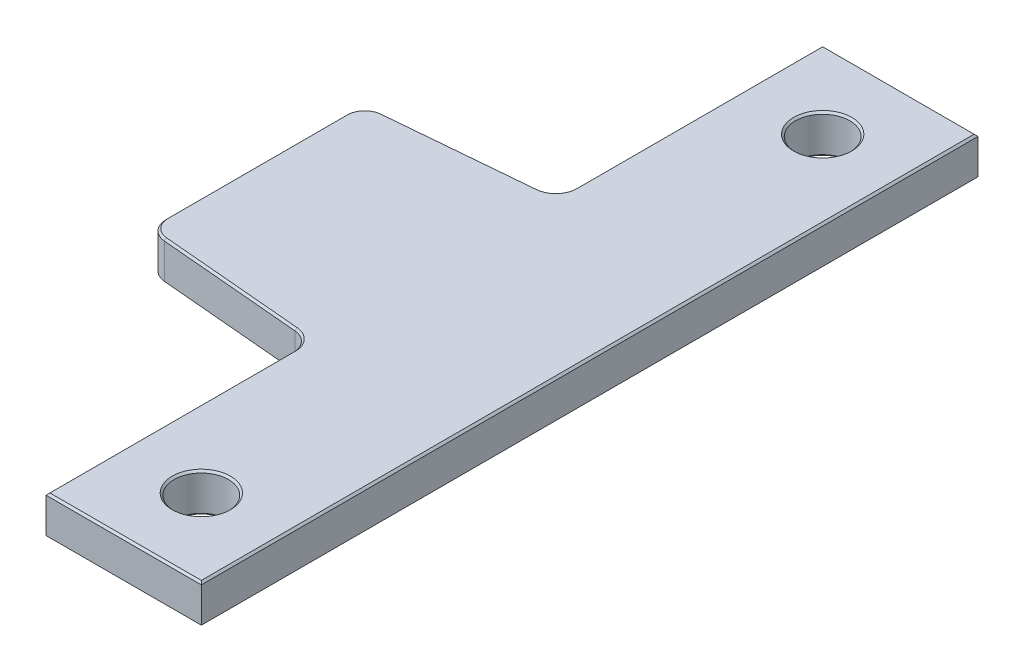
ISO-10303-21;
HEADER;
FILE_DESCRIPTION(('STEP AP214'),'2;1');
FILE_NAME('part.step','',(''),(''),'','','');
FILE_SCHEMA(('AUTOMOTIVE_DESIGN { 1 0 10303 214 1 1 1 1 }'));
ENDSEC;
DATA;
#1=APPLICATION_CONTEXT('core data for automotive mechanical design processes');
#2=APPLICATION_PROTOCOL_DEFINITION('international standard','automotive_design',2000,#1);
#3=PRODUCT_CONTEXT('',#1,'mechanical');
#4=PRODUCT('Part','Part','',(#3));
#5=PRODUCT_RELATED_PRODUCT_CATEGORY('part','',(#4));
#6=PRODUCT_DEFINITION_FORMATION('','',#4);
#7=PRODUCT_DEFINITION_CONTEXT('part definition',#1,'design');
#8=PRODUCT_DEFINITION('design','',#6,#7);
#9=PRODUCT_DEFINITION_SHAPE('','',#8);
#10=(LENGTH_UNIT() NAMED_UNIT(*) SI_UNIT(.MILLI.,.METRE.));
#11=(NAMED_UNIT(*) PLANE_ANGLE_UNIT() SI_UNIT($,.RADIAN.));
#12=(NAMED_UNIT(*) SI_UNIT($,.STERADIAN.) SOLID_ANGLE_UNIT());
#13=UNCERTAINTY_MEASURE_WITH_UNIT(LENGTH_MEASURE(1.E-05),#10,'distance_accuracy_value','');
#14=(GEOMETRIC_REPRESENTATION_CONTEXT(3) GLOBAL_UNCERTAINTY_ASSIGNED_CONTEXT((#13)) GLOBAL_UNIT_ASSIGNED_CONTEXT((#10,
#11,#12)) REPRESENTATION_CONTEXT('',''));
#15=CARTESIAN_POINT('',(0.,0.,0.));
#16=DIRECTION('',(0.,0.,1.));
#17=DIRECTION('',(1.,0.,0.));
#18=AXIS2_PLACEMENT_3D('',#15,#16,#17);
#19=CARTESIAN_POINT('',(0.,10.,-100.));
#20=DIRECTION('',(-1.,0.,0.));
#21=DIRECTION('',(0.,0.,1.));
#22=AXIS2_PLACEMENT_3D('',#19,#20,#21);
#23=PLANE('',#22);
#24=DIRECTION('',(0.,-1.,0.));
#25=VECTOR('',#24,1.);
#26=CARTESIAN_POINT('',(0.,10.,100.));
#27=LINE('',#26,#25);
#28=CARTESIAN_POINT('',(0.,9.5,100.));
#29=VERTEX_POINT('',#28);
#30=CARTESIAN_POINT('',(0.,0.5,100.));
#31=VERTEX_POINT('',#30);
#32=EDGE_CURVE('E395',#29,#31,#27,.T.);
#33=ORIENTED_EDGE('',*,*,#32,.T.);
#34=DIRECTION('',(0.,0.,-1.));
#35=VECTOR('',#34,1.);
#36=CARTESIAN_POINT('',(0.,0.5,-100.));
#37=LINE('',#36,#35);
#38=CARTESIAN_POINT('',(0.,0.5,-100.));
#39=VERTEX_POINT('',#38);
#40=EDGE_CURVE('E253',#31,#39,#37,.T.);
#41=ORIENTED_EDGE('',*,*,#40,.T.);
#42=DIRECTION('',(0.,-1.,0.));
#43=VECTOR('',#42,1.);
#44=CARTESIAN_POINT('',(0.,10.,-100.));
#45=LINE('',#44,#43);
#46=CARTESIAN_POINT('',(0.,9.5,-100.));
#47=VERTEX_POINT('',#46);
#48=EDGE_CURVE('E407',#47,#39,#45,.T.);
#49=ORIENTED_EDGE('',*,*,#48,.F.);
#50=DIRECTION('',(0.,0.,1.));
#51=VECTOR('',#50,1.);
#52=CARTESIAN_POINT('',(0.,9.5,-100.));
#53=LINE('',#52,#51);
#54=EDGE_CURVE('E251',#47,#29,#53,.T.);
#55=ORIENTED_EDGE('',*,*,#54,.T.);
#56=EDGE_LOOP('',(#33,#41,#49,#55));
#57=FACE_BOUND('',#56,.T.);
#58=ADVANCED_FACE('F30',(#57),#23,.F.);
#59=CARTESIAN_POINT('',(0.,10.,-100.));
#60=DIRECTION('',(0.,0.,1.));
#61=DIRECTION('',(1.,0.,0.));
#62=AXIS2_PLACEMENT_3D('',#59,#60,#61);
#63=PLANE('',#62);
#64=ORIENTED_EDGE('',*,*,#48,.T.);
#65=DIRECTION('',(-1.,0.,0.));
#66=VECTOR('',#65,1.);
#67=CARTESIAN_POINT('',(-40.,0.5,-100.));
#68=LINE('',#67,#66);
#69=CARTESIAN_POINT('',(-40.,0.5,-100.));
#70=VERTEX_POINT('',#69);
#71=EDGE_CURVE('E257',#39,#70,#68,.T.);
#72=ORIENTED_EDGE('',*,*,#71,.T.);
#73=DIRECTION('',(0.,1.,0.));
#74=VECTOR('',#73,1.);
#75=CARTESIAN_POINT('',(-40.,0.,-100.));
#76=LINE('',#75,#74);
#77=CARTESIAN_POINT('',(-40.,9.5,-100.));
#78=VERTEX_POINT('',#77);
#79=EDGE_CURVE('E401',#70,#78,#76,.T.);
#80=ORIENTED_EDGE('',*,*,#79,.T.);
#81=DIRECTION('',(1.,0.,0.));
#82=VECTOR('',#81,1.);
#83=CARTESIAN_POINT('',(0.,9.5,-100.));
#84=LINE('',#83,#82);
#85=EDGE_CURVE('E255',#78,#47,#84,.T.);
#86=ORIENTED_EDGE('',*,*,#85,.T.);
#87=EDGE_LOOP('',(#64,#72,#80,#86));
#88=FACE_BOUND('',#87,.T.);
#89=ADVANCED_FACE('F523',(#88),#63,.F.);
#90=CARTESIAN_POINT('',(0.,10.,100.));
#91=DIRECTION('',(0.,0.,-1.));
#92=DIRECTION('',(-1.,0.,0.));
#93=AXIS2_PLACEMENT_3D('',#90,#91,#92);
#94=PLANE('',#93);
#95=DIRECTION('',(0.,1.,0.));
#96=VECTOR('',#95,1.);
#97=CARTESIAN_POINT('',(-40.,0.,100.));
#98=LINE('',#97,#96);
#99=CARTESIAN_POINT('',(-40.,0.5,100.));
#100=VERTEX_POINT('',#99);
#101=CARTESIAN_POINT('',(-40.,9.5,100.));
#102=VERTEX_POINT('',#101);
#103=EDGE_CURVE('E343',#100,#102,#98,.T.);
#104=ORIENTED_EDGE('',*,*,#103,.F.);
#105=DIRECTION('',(1.,0.,0.));
#106=VECTOR('',#105,1.);
#107=CARTESIAN_POINT('',(0.,0.5,100.));
#108=LINE('',#107,#106);
#109=EDGE_CURVE('E249',#100,#31,#108,.T.);
#110=ORIENTED_EDGE('',*,*,#109,.T.);
#111=ORIENTED_EDGE('',*,*,#32,.F.);
#112=DIRECTION('',(-1.,0.,0.));
#113=VECTOR('',#112,1.);
#114=CARTESIAN_POINT('',(0.,9.5,100.));
#115=LINE('',#114,#113);
#116=EDGE_CURVE('E247',#29,#102,#115,.T.);
#117=ORIENTED_EDGE('',*,*,#116,.T.);
#118=EDGE_LOOP('',(#104,#110,#111,#117));
#119=FACE_BOUND('',#118,.T.);
#120=ADVANCED_FACE('F392',(#119),#94,.F.);
#121=CARTESIAN_POINT('',(0.,10.,100.));
#122=DIRECTION('',(0.,-1.,0.));
#123=DIRECTION('',(0.,0.,-1.));
#124=AXIS2_PLACEMENT_3D('',#121,#122,#123);
#125=PLANE('',#124);
#126=DIRECTION('',(-0.996197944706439,0.,0.0871186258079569));
#127=VECTOR('',#126,1.);
#128=CARTESIAN_POINT('',(-11.6899269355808,10.,-33.673839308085));
#129=LINE('',#128,#127);
#130=CARTESIAN_POINT('',(-44.5208475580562,10.,-30.8027385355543));
#131=VERTEX_POINT('',#130);
#132=CARTESIAN_POINT('',(-81.3920338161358,10.,-27.5783120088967));
#133=VERTEX_POINT('',#132);
#134=EDGE_CURVE('E39',#131,#133,#129,.T.);
#135=ORIENTED_EDGE('',*,*,#134,.T.);
#136=CARTESIAN_POINT('',(-81.,10.,-23.0954212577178));
#137=DIRECTION('',(0.,-1.,0.));
#138=DIRECTION('',(0.,0.,-1.));
#139=AXIS2_PLACEMENT_3D('',#136,#137,#138);
#140=CIRCLE('',#139,4.5);
#141=CARTESIAN_POINT('',(-85.5,10.,-23.0954212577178));
#142=VERTEX_POINT('',#141);
#143=EDGE_CURVE('E11',#133,#142,#140,.F.);
#144=ORIENTED_EDGE('',*,*,#143,.T.);
#145=DIRECTION('',(0.,0.,1.));
#146=VECTOR('',#145,1.);
#147=CARTESIAN_POINT('',(-85.5,10.,100.));
#148=LINE('',#147,#146);
#149=CARTESIAN_POINT('',(-85.5,10.,23.0954212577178));
#150=VERTEX_POINT('',#149);
#151=EDGE_CURVE('E294',#142,#150,#148,.T.);
#152=ORIENTED_EDGE('',*,*,#151,.T.);
#153=CARTESIAN_POINT('',(-81.,10.,23.0954212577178));
#154=DIRECTION('',(0.,-1.,0.));
#155=DIRECTION('',(0.,0.,-1.));
#156=AXIS2_PLACEMENT_3D('',#153,#154,#155);
#157=CIRCLE('',#156,4.5);
#158=CARTESIAN_POINT('',(-81.3920338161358,10.,27.5783120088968));
#159=VERTEX_POINT('',#158);
#160=EDGE_CURVE('E296',#150,#159,#157,.F.);
#161=ORIENTED_EDGE('',*,*,#160,.T.);
#162=DIRECTION('',(0.996197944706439,0.,0.0871186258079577));
#163=VECTOR('',#162,1.);
#164=CARTESIAN_POINT('',(5.66755225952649,10.,35.1917703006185));
#165=LINE('',#164,#163);
#166=CARTESIAN_POINT('',(-44.5208475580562,10.,30.8027385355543));
#167=VERTEX_POINT('',#166);
#168=EDGE_CURVE('E298',#159,#167,#165,.T.);
#169=ORIENTED_EDGE('',*,*,#168,.T.);
#170=CARTESIAN_POINT('',(-45.,10.,36.2818272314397));
#171=DIRECTION('',(0.,-1.,0.));
#172=DIRECTION('',(0.,0.,-1.));
#173=AXIS2_PLACEMENT_3D('',#170,#171,#172);
#174=CIRCLE('',#173,5.50000000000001);
#175=CARTESIAN_POINT('',(-39.5,10.,36.2818272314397));
#176=VERTEX_POINT('',#175);
#177=EDGE_CURVE('E300',#167,#176,#174,.T.);
#178=ORIENTED_EDGE('',*,*,#177,.T.);
#179=DIRECTION('',(0.,0.,1.));
#180=VECTOR('',#179,1.);
#181=CARTESIAN_POINT('',(-39.5,10.,100.));
#182=LINE('',#181,#180);
#183=CARTESIAN_POINT('',(-39.5,10.,99.5));
#184=VERTEX_POINT('',#183);
#185=EDGE_CURVE('E302',#176,#184,#182,.T.);
#186=ORIENTED_EDGE('',*,*,#185,.T.);
#187=DIRECTION('',(1.,0.,0.));
#188=VECTOR('',#187,1.);
#189=CARTESIAN_POINT('',(0.,10.,99.5));
#190=LINE('',#189,#188);
#191=CARTESIAN_POINT('',(-0.49999999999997,10.,99.5));
#192=VERTEX_POINT('',#191);
#193=EDGE_CURVE('E304',#184,#192,#190,.T.);
#194=ORIENTED_EDGE('',*,*,#193,.T.);
#195=DIRECTION('',(0.,0.,-1.));
#196=VECTOR('',#195,1.);
#197=CARTESIAN_POINT('',(-0.49999999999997,10.,100.));
#198=LINE('',#197,#196);
#199=CARTESIAN_POINT('',(-0.49999999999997,10.,-99.5));
#200=VERTEX_POINT('',#199);
#201=EDGE_CURVE('E306',#192,#200,#198,.T.);
#202=ORIENTED_EDGE('',*,*,#201,.T.);
#203=DIRECTION('',(-1.,0.,0.));
#204=VECTOR('',#203,1.);
#205=CARTESIAN_POINT('',(0.,10.,-99.5));
#206=LINE('',#205,#204);
#207=CARTESIAN_POINT('',(-39.5,10.,-99.5));
#208=VERTEX_POINT('',#207);
#209=EDGE_CURVE('E308',#200,#208,#206,.T.);
#210=ORIENTED_EDGE('',*,*,#209,.T.);
#211=DIRECTION('',(0.,0.,1.));
#212=VECTOR('',#211,1.);
#213=CARTESIAN_POINT('',(-39.5,10.,100.));
#214=LINE('',#213,#212);
#215=CARTESIAN_POINT('',(-39.5,10.,-36.2818272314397));
#216=VERTEX_POINT('',#215);
#217=EDGE_CURVE('E310',#208,#216,#214,.T.);
#218=ORIENTED_EDGE('',*,*,#217,.T.);
#219=CARTESIAN_POINT('',(-45.,10.,-36.2818272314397));
#220=DIRECTION('',(0.,-1.,0.));
#221=DIRECTION('',(0.,0.,-1.));
#222=AXIS2_PLACEMENT_3D('',#219,#220,#221);
#223=CIRCLE('',#222,5.5);
#224=EDGE_CURVE('E50',#216,#131,#223,.T.);
#225=ORIENTED_EDGE('',*,*,#224,.T.);
#226=EDGE_LOOP('',(#135,#144,#152,#161,#169,#178,#186,#194,#202,#210,#218,#225));
#227=FACE_BOUND('',#226,.T.);
#228=CARTESIAN_POINT('',(-20.,10.,-80.));
#229=DIRECTION('',(0.,-1.,0.));
#230=DIRECTION('',(0.,0.,-1.));
#231=AXIS2_PLACEMENT_3D('',#228,#229,#230);
#232=CIRCLE('',#231,7.50000000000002);
#233=CARTESIAN_POINT('',(-20.,10.,-87.5));
#234=VERTEX_POINT('',#233);
#235=EDGE_CURVE('E291',#234,#234,#232,.T.);
#236=ORIENTED_EDGE('',*,*,#235,.T.);
#237=EDGE_LOOP('',(#236));
#238=FACE_BOUND('',#237,.T.);
#239=CARTESIAN_POINT('',(-20.,10.,80.));
#240=DIRECTION('',(0.,-1.,0.));
#241=DIRECTION('',(0.,0.,-1.));
#242=AXIS2_PLACEMENT_3D('',#239,#240,#241);
#243=CIRCLE('',#242,7.50000000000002);
#244=CARTESIAN_POINT('',(-20.,10.,72.5));
#245=VERTEX_POINT('',#244);
#246=EDGE_CURVE('E288',#245,#245,#243,.T.);
#247=ORIENTED_EDGE('',*,*,#246,.T.);
#248=EDGE_LOOP('',(#247));
#249=FACE_BOUND('',#248,.T.);
#250=ADVANCED_FACE('F535',(#227,#238,#249),#125,.F.);
#251=CARTESIAN_POINT('',(0.,0.,100.));
#252=DIRECTION('',(0.,-1.,0.));
#253=DIRECTION('',(0.,0.,-1.));
#254=AXIS2_PLACEMENT_3D('',#251,#252,#253);
#255=PLANE('',#254);
#256=CARTESIAN_POINT('',(-20.,0.,-80.));
#257=DIRECTION('',(0.,-1.,0.));
#258=DIRECTION('',(0.,0.,-1.));
#259=AXIS2_PLACEMENT_3D('',#256,#257,#258);
#260=CIRCLE('',#259,7.49999999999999);
#261=CARTESIAN_POINT('',(-20.,0.,-87.5));
#262=VERTEX_POINT('',#261);
#263=EDGE_CURVE('E220',#262,#262,#260,.F.);
#264=ORIENTED_EDGE('',*,*,#263,.T.);
#265=EDGE_LOOP('',(#264));
#266=FACE_BOUND('',#265,.T.);
#267=CARTESIAN_POINT('',(-20.,0.,80.));
#268=DIRECTION('',(0.,-1.,0.));
#269=DIRECTION('',(0.,0.,-1.));
#270=AXIS2_PLACEMENT_3D('',#267,#268,#269);
#271=CIRCLE('',#270,7.49999999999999);
#272=CARTESIAN_POINT('',(-20.,0.,72.5));
#273=VERTEX_POINT('',#272);
#274=EDGE_CURVE('E217',#273,#273,#271,.F.);
#275=ORIENTED_EDGE('',*,*,#274,.T.);
#276=EDGE_LOOP('',(#275));
#277=FACE_BOUND('',#276,.T.);
#278=DIRECTION('',(0.,0.,-1.));
#279=VECTOR('',#278,1.);
#280=CARTESIAN_POINT('',(-39.5,0.,36.2818272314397));
#281=LINE('',#280,#279);
#282=CARTESIAN_POINT('',(-39.5,0.,99.5));
#283=VERTEX_POINT('',#282);
#284=CARTESIAN_POINT('',(-39.5,0.,36.2818272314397));
#285=VERTEX_POINT('',#284);
#286=EDGE_CURVE('E215',#283,#285,#281,.T.);
#287=ORIENTED_EDGE('',*,*,#286,.T.);
#288=CARTESIAN_POINT('',(-45.,0.,36.2818272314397));
#289=DIRECTION('',(0.,-1.,0.));
#290=DIRECTION('',(0.,0.,-1.));
#291=AXIS2_PLACEMENT_3D('',#288,#289,#290);
#292=CIRCLE('',#291,5.50000000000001);
#293=CARTESIAN_POINT('',(-44.5208475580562,0.,30.8027385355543));
#294=VERTEX_POINT('',#293);
#295=EDGE_CURVE('E196',#285,#294,#292,.F.);
#296=ORIENTED_EDGE('',*,*,#295,.T.);
#297=DIRECTION('',(-0.996197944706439,0.,-0.0871186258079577));
#298=VECTOR('',#297,1.);
#299=CARTESIAN_POINT('',(-81.3920338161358,0.,27.5783120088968));
#300=LINE('',#299,#298);
#301=CARTESIAN_POINT('',(-81.3920338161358,0.,27.5783120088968));
#302=VERTEX_POINT('',#301);
#303=EDGE_CURVE('E204',#294,#302,#300,.T.);
#304=ORIENTED_EDGE('',*,*,#303,.T.);
#305=CARTESIAN_POINT('',(-81.,0.,23.0954212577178));
#306=DIRECTION('',(0.,-1.,0.));
#307=DIRECTION('',(0.,0.,-1.));
#308=AXIS2_PLACEMENT_3D('',#305,#306,#307);
#309=CIRCLE('',#308,4.49999999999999);
#310=CARTESIAN_POINT('',(-85.5,0.,23.0954212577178));
#311=VERTEX_POINT('',#310);
#312=EDGE_CURVE('E210',#302,#311,#309,.T.);
#313=ORIENTED_EDGE('',*,*,#312,.T.);
#314=DIRECTION('',(0.,0.,-1.));
#315=VECTOR('',#314,1.);
#316=CARTESIAN_POINT('',(-85.5,0.,-23.0954212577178));
#317=LINE('',#316,#315);
#318=CARTESIAN_POINT('',(-85.5,0.,-23.0954212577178));
#319=VERTEX_POINT('',#318);
#320=EDGE_CURVE('E433',#311,#319,#317,.T.);
#321=ORIENTED_EDGE('',*,*,#320,.T.);
#322=CARTESIAN_POINT('',(-81.,0.,-23.0954212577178));
#323=DIRECTION('',(0.,-1.,0.));
#324=DIRECTION('',(0.,0.,-1.));
#325=AXIS2_PLACEMENT_3D('',#322,#323,#324);
#326=CIRCLE('',#325,4.49999999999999);
#327=CARTESIAN_POINT('',(-81.3920338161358,0.,-27.5783120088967));
#328=VERTEX_POINT('',#327);
#329=EDGE_CURVE('E435',#319,#328,#326,.T.);
#330=ORIENTED_EDGE('',*,*,#329,.T.);
#331=DIRECTION('',(0.996197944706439,0.,-0.0871186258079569));
#332=VECTOR('',#331,1.);
#333=CARTESIAN_POINT('',(-44.5208475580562,0.,-30.8027385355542));
#334=LINE('',#333,#332);
#335=CARTESIAN_POINT('',(-44.5208475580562,0.,-30.8027385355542));
#336=VERTEX_POINT('',#335);
#337=EDGE_CURVE('E437',#328,#336,#334,.T.);
#338=ORIENTED_EDGE('',*,*,#337,.T.);
#339=CARTESIAN_POINT('',(-45.,0.,-36.2818272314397));
#340=DIRECTION('',(0.,-1.,0.));
#341=DIRECTION('',(0.,0.,-1.));
#342=AXIS2_PLACEMENT_3D('',#339,#340,#341);
#343=CIRCLE('',#342,5.50000000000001);
#344=CARTESIAN_POINT('',(-39.5,0.,-36.2818272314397));
#345=VERTEX_POINT('',#344);
#346=EDGE_CURVE('E439',#336,#345,#343,.F.);
#347=ORIENTED_EDGE('',*,*,#346,.T.);
#348=DIRECTION('',(0.,0.,-1.));
#349=VECTOR('',#348,1.);
#350=CARTESIAN_POINT('',(-39.5,0.,-100.));
#351=LINE('',#350,#349);
#352=CARTESIAN_POINT('',(-39.5,0.,-99.5));
#353=VERTEX_POINT('',#352);
#354=EDGE_CURVE('E441',#345,#353,#351,.T.);
#355=ORIENTED_EDGE('',*,*,#354,.T.);
#356=DIRECTION('',(1.,0.,0.));
#357=VECTOR('',#356,1.);
#358=CARTESIAN_POINT('',(0.,0.,-99.5));
#359=LINE('',#358,#357);
#360=CARTESIAN_POINT('',(-0.499999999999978,0.,-99.5));
#361=VERTEX_POINT('',#360);
#362=EDGE_CURVE('E443',#353,#361,#359,.T.);
#363=ORIENTED_EDGE('',*,*,#362,.T.);
#364=DIRECTION('',(0.,0.,1.));
#365=VECTOR('',#364,1.);
#366=CARTESIAN_POINT('',(-0.499999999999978,0.,100.));
#367=LINE('',#366,#365);
#368=CARTESIAN_POINT('',(-0.499999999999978,0.,99.5));
#369=VERTEX_POINT('',#368);
#370=EDGE_CURVE('E445',#361,#369,#367,.T.);
#371=ORIENTED_EDGE('',*,*,#370,.T.);
#372=DIRECTION('',(-1.,0.,0.));
#373=VECTOR('',#372,1.);
#374=CARTESIAN_POINT('',(-40.,0.,99.5));
#375=LINE('',#374,#373);
#376=EDGE_CURVE('E222',#369,#283,#375,.T.);
#377=ORIENTED_EDGE('',*,*,#376,.T.);
#378=EDGE_LOOP('',(#287,#296,#304,#313,#321,#330,#338,#347,#355,#363,#371,#377));
#379=FACE_BOUND('',#378,.T.);
#380=ADVANCED_FACE('F213',(#266,#277,#379),#255,.T.);
#381=CARTESIAN_POINT('',(-20.,10.,-80.));
#382=DIRECTION('',(0.,1.,0.));
#383=DIRECTION('',(0.,0.,1.));
#384=AXIS2_PLACEMENT_3D('',#381,#382,#383);
#385=CYLINDRICAL_SURFACE('',#384,7.);
#386=CARTESIAN_POINT('',(-20.,0.50000000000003,-80.));
#387=DIRECTION('',(0.,-1.,0.));
#388=DIRECTION('',(0.,0.,-1.));
#389=AXIS2_PLACEMENT_3D('',#386,#387,#388);
#390=CIRCLE('',#389,7.);
#391=CARTESIAN_POINT('',(-20.,0.50000000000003,-87.));
#392=VERTEX_POINT('',#391);
#393=EDGE_CURVE('E231',#392,#392,#390,.T.);
#394=ORIENTED_EDGE('',*,*,#393,.T.);
#395=EDGE_LOOP('',(#394));
#396=FACE_BOUND('',#395,.T.);
#397=CARTESIAN_POINT('',(-20.,9.49999999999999,-80.));
#398=DIRECTION('',(0.,-1.,0.));
#399=DIRECTION('',(0.,0.,-1.));
#400=AXIS2_PLACEMENT_3D('',#397,#398,#399);
#401=CIRCLE('',#400,7.);
#402=CARTESIAN_POINT('',(-20.,9.49999999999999,-87.));
#403=VERTEX_POINT('',#402);
#404=EDGE_CURVE('E228',#403,#403,#401,.F.);
#405=ORIENTED_EDGE('',*,*,#404,.T.);
#406=EDGE_LOOP('',(#405));
#407=FACE_BOUND('',#406,.T.);
#408=ADVANCED_FACE('F844',(#396,#407),#385,.F.);
#409=CARTESIAN_POINT('',(-20.,10.,80.));
#410=DIRECTION('',(0.,1.,0.));
#411=DIRECTION('',(0.,0.,1.));
#412=AXIS2_PLACEMENT_3D('',#409,#410,#411);
#413=CYLINDRICAL_SURFACE('',#412,7.);
#414=CARTESIAN_POINT('',(-20.,0.50000000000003,80.));
#415=DIRECTION('',(0.,-1.,0.));
#416=DIRECTION('',(0.,0.,-1.));
#417=AXIS2_PLACEMENT_3D('',#414,#415,#416);
#418=CIRCLE('',#417,7.);
#419=CARTESIAN_POINT('',(-20.,0.50000000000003,73.));
#420=VERTEX_POINT('',#419);
#421=EDGE_CURVE('E237',#420,#420,#418,.T.);
#422=ORIENTED_EDGE('',*,*,#421,.T.);
#423=EDGE_LOOP('',(#422));
#424=FACE_BOUND('',#423,.T.);
#425=CARTESIAN_POINT('',(-20.,9.49999999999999,80.));
#426=DIRECTION('',(0.,-1.,0.));
#427=DIRECTION('',(0.,0.,-1.));
#428=AXIS2_PLACEMENT_3D('',#425,#426,#427);
#429=CIRCLE('',#428,7.);
#430=CARTESIAN_POINT('',(-20.,9.49999999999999,73.));
#431=VERTEX_POINT('',#430);
#432=EDGE_CURVE('E234',#431,#431,#429,.F.);
#433=ORIENTED_EDGE('',*,*,#432,.T.);
#434=EDGE_LOOP('',(#433));
#435=FACE_BOUND('',#434,.T.);
#436=ADVANCED_FACE('F835',(#424,#435),#413,.F.);
#437=CARTESIAN_POINT('',(-40.,0.,-31.7));
#438=DIRECTION('',(1.,0.,0.));
#439=DIRECTION('',(0.,0.,-1.));
#440=AXIS2_PLACEMENT_3D('',#437,#438,#439);
#441=PLANE('',#440);
#442=ORIENTED_EDGE('',*,*,#79,.F.);
#443=DIRECTION('',(0.,0.,1.));
#444=VECTOR('',#443,1.);
#445=CARTESIAN_POINT('',(-40.,0.5,-36.2818272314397));
#446=LINE('',#445,#444);
#447=CARTESIAN_POINT('',(-40.,0.5,-36.2818272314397));
#448=VERTEX_POINT('',#447);
#449=EDGE_CURVE('E261',#70,#448,#446,.T.);
#450=ORIENTED_EDGE('',*,*,#449,.T.);
#451=DIRECTION('',(0.,1.,0.));
#452=VECTOR('',#451,1.);
#453=CARTESIAN_POINT('',(-40.,10.,-36.2818272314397));
#454=LINE('',#453,#452);
#455=CARTESIAN_POINT('',(-40.,9.5,-36.2818272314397));
#456=VERTEX_POINT('',#455);
#457=EDGE_CURVE('E211',#448,#456,#454,.T.);
#458=ORIENTED_EDGE('',*,*,#457,.T.);
#459=DIRECTION('',(0.,0.,-1.));
#460=VECTOR('',#459,1.);
#461=CARTESIAN_POINT('',(-40.,9.5,-31.7));
#462=LINE('',#461,#460);
#463=EDGE_CURVE('E259',#456,#78,#462,.T.);
#464=ORIENTED_EDGE('',*,*,#463,.T.);
#465=EDGE_LOOP('',(#442,#450,#458,#464));
#466=FACE_BOUND('',#465,.T.);
#467=ADVANCED_FACE('F826',(#466),#441,.F.);
#468=CARTESIAN_POINT('',(-86.,0.,-27.6772484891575));
#469=DIRECTION('',(0.0871186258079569,0.,0.996197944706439));
#470=DIRECTION('',(0.996197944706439,0.,-0.0871186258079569));
#471=AXIS2_PLACEMENT_3D('',#468,#469,#470);
#472=PLANE('',#471);
#473=DIRECTION('',(0.,1.,0.));
#474=VECTOR('',#473,1.);
#475=CARTESIAN_POINT('',(-44.5644068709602,0.,-31.3008375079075));
#476=LINE('',#475,#474);
#477=CARTESIAN_POINT('',(-44.5644068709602,9.5,-31.3008375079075));
#478=VERTEX_POINT('',#477);
#479=CARTESIAN_POINT('',(-44.5644068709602,0.500000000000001,-31.3008375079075));
#480=VERTEX_POINT('',#479);
#481=EDGE_CURVE('E424',#478,#480,#476,.F.);
#482=ORIENTED_EDGE('',*,*,#481,.T.);
#483=DIRECTION('',(-0.996197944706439,0.,0.0871186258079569));
#484=VECTOR('',#483,1.);
#485=CARTESIAN_POINT('',(-81.4355931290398,0.500000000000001,-28.07641098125));
#486=LINE('',#485,#484);
#487=CARTESIAN_POINT('',(-81.4355931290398,0.5,-28.07641098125));
#488=VERTEX_POINT('',#487);
#489=EDGE_CURVE('E269',#480,#488,#486,.T.);
#490=ORIENTED_EDGE('',*,*,#489,.T.);
#491=DIRECTION('',(0.,1.,0.));
#492=VECTOR('',#491,1.);
#493=CARTESIAN_POINT('',(-81.4355931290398,0.,-28.07641098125));
#494=LINE('',#493,#492);
#495=CARTESIAN_POINT('',(-81.4355931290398,9.5,-28.07641098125));
#496=VERTEX_POINT('',#495);
#497=EDGE_CURVE('E427',#488,#496,#494,.T.);
#498=ORIENTED_EDGE('',*,*,#497,.T.);
#499=DIRECTION('',(0.996197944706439,0.,-0.0871186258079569));
#500=VECTOR('',#499,1.);
#501=CARTESIAN_POINT('',(-86.,9.5,-27.6772484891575));
#502=LINE('',#501,#500);
#503=EDGE_CURVE('E267',#496,#478,#502,.T.);
#504=ORIENTED_EDGE('',*,*,#503,.T.);
#505=EDGE_LOOP('',(#482,#490,#498,#504));
#506=FACE_BOUND('',#505,.T.);
#507=ADVANCED_FACE('F818',(#506),#472,.F.);
#508=CARTESIAN_POINT('',(-86.,0.,27.6772484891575));
#509=DIRECTION('',(1.,0.,0.));
#510=DIRECTION('',(0.,0.,-1.));
#511=AXIS2_PLACEMENT_3D('',#508,#509,#510);
#512=PLANE('',#511);
#513=DIRECTION('',(0.,1.,0.));
#514=VECTOR('',#513,1.);
#515=CARTESIAN_POINT('',(-86.,0.,-23.0954212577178));
#516=LINE('',#515,#514);
#517=CARTESIAN_POINT('',(-86.,9.5,-23.0954212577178));
#518=VERTEX_POINT('',#517);
#519=CARTESIAN_POINT('',(-86.,0.5,-23.0954212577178));
#520=VERTEX_POINT('',#519);
#521=EDGE_CURVE('E418',#518,#520,#516,.F.);
#522=ORIENTED_EDGE('',*,*,#521,.T.);
#523=DIRECTION('',(0.,0.,1.));
#524=VECTOR('',#523,1.);
#525=CARTESIAN_POINT('',(-86.,0.5,23.0954212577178));
#526=LINE('',#525,#524);
#527=CARTESIAN_POINT('',(-86.,0.5,23.0954212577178));
#528=VERTEX_POINT('',#527);
#529=EDGE_CURVE('E278',#520,#528,#526,.T.);
#530=ORIENTED_EDGE('',*,*,#529,.T.);
#531=DIRECTION('',(0.,1.,0.));
#532=VECTOR('',#531,1.);
#533=CARTESIAN_POINT('',(-86.,0.,23.0954212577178));
#534=LINE('',#533,#532);
#535=CARTESIAN_POINT('',(-86.,9.5,23.0954212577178));
#536=VERTEX_POINT('',#535);
#537=EDGE_CURVE('E421',#528,#536,#534,.T.);
#538=ORIENTED_EDGE('',*,*,#537,.T.);
#539=DIRECTION('',(0.,0.,-1.));
#540=VECTOR('',#539,1.);
#541=CARTESIAN_POINT('',(-86.,9.5,27.6772484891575));
#542=LINE('',#541,#540);
#543=EDGE_CURVE('E276',#536,#518,#542,.T.);
#544=ORIENTED_EDGE('',*,*,#543,.T.);
#545=EDGE_LOOP('',(#522,#530,#538,#544));
#546=FACE_BOUND('',#545,.T.);
#547=ADVANCED_FACE('F482',(#546),#512,.F.);
#548=CARTESIAN_POINT('',(-40.,0.,31.7));
#549=DIRECTION('',(0.0871186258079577,0.,-0.996197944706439));
#550=DIRECTION('',(-0.996197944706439,0.,-0.0871186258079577));
#551=AXIS2_PLACEMENT_3D('',#548,#549,#550);
#552=PLANE('',#551);
#553=DIRECTION('',(0.,1.,0.));
#554=VECTOR('',#553,1.);
#555=CARTESIAN_POINT('',(-81.4355931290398,0.,28.07641098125));
#556=LINE('',#555,#554);
#557=CARTESIAN_POINT('',(-81.4355931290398,9.5,28.07641098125));
#558=VERTEX_POINT('',#557);
#559=CARTESIAN_POINT('',(-81.4355931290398,0.5,28.07641098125));
#560=VERTEX_POINT('',#559);
#561=EDGE_CURVE('E410',#558,#560,#556,.F.);
#562=ORIENTED_EDGE('',*,*,#561,.T.);
#563=DIRECTION('',(0.996197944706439,0.,0.0871186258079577));
#564=VECTOR('',#563,1.);
#565=CARTESIAN_POINT('',(-44.5644068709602,0.5,31.3008375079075));
#566=LINE('',#565,#564);
#567=CARTESIAN_POINT('',(-44.5644068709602,0.5,31.3008375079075));
#568=VERTEX_POINT('',#567);
#569=EDGE_CURVE('E286',#560,#568,#566,.T.);
#570=ORIENTED_EDGE('',*,*,#569,.T.);
#571=DIRECTION('',(0.,1.,0.));
#572=VECTOR('',#571,1.);
#573=CARTESIAN_POINT('',(-44.5644068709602,10.,31.3008375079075));
#574=LINE('',#573,#572);
#575=CARTESIAN_POINT('',(-44.5644068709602,9.5,31.3008375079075));
#576=VERTEX_POINT('',#575);
#577=EDGE_CURVE('E413',#568,#576,#574,.T.);
#578=ORIENTED_EDGE('',*,*,#577,.T.);
#579=DIRECTION('',(-0.996197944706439,0.,-0.0871186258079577));
#580=VECTOR('',#579,1.);
#581=CARTESIAN_POINT('',(-40.,9.5,31.7));
#582=LINE('',#581,#580);
#583=EDGE_CURVE('E284',#576,#558,#582,.T.);
#584=ORIENTED_EDGE('',*,*,#583,.T.);
#585=EDGE_LOOP('',(#562,#570,#578,#584));
#586=FACE_BOUND('',#585,.T.);
#587=ADVANCED_FACE('F461',(#586),#552,.F.);
#588=CARTESIAN_POINT('',(-40.,0.,100.));
#589=DIRECTION('',(1.,0.,0.));
#590=DIRECTION('',(0.,0.,-1.));
#591=AXIS2_PLACEMENT_3D('',#588,#589,#590);
#592=PLANE('',#591);
#593=DIRECTION('',(0.,1.,0.));
#594=VECTOR('',#593,1.);
#595=CARTESIAN_POINT('',(-40.,0.,36.2818272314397));
#596=LINE('',#595,#594);
#597=CARTESIAN_POINT('',(-40.,9.5,36.2818272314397));
#598=VERTEX_POINT('',#597);
#599=CARTESIAN_POINT('',(-40.,0.5,36.2818272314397));
#600=VERTEX_POINT('',#599);
#601=EDGE_CURVE('E416',#598,#600,#596,.F.);
#602=ORIENTED_EDGE('',*,*,#601,.T.);
#603=DIRECTION('',(0.,0.,1.));
#604=VECTOR('',#603,1.);
#605=CARTESIAN_POINT('',(-40.,0.5,100.));
#606=LINE('',#605,#604);
#607=EDGE_CURVE('E245',#600,#100,#606,.T.);
#608=ORIENTED_EDGE('',*,*,#607,.T.);
#609=ORIENTED_EDGE('',*,*,#103,.T.);
#610=DIRECTION('',(0.,0.,-1.));
#611=VECTOR('',#610,1.);
#612=CARTESIAN_POINT('',(-40.,9.5,100.));
#613=LINE('',#612,#611);
#614=EDGE_CURVE('E243',#102,#598,#613,.T.);
#615=ORIENTED_EDGE('',*,*,#614,.T.);
#616=EDGE_LOOP('',(#602,#608,#609,#615));
#617=FACE_BOUND('',#616,.T.);
#618=ADVANCED_FACE('F398',(#617),#592,.F.);
#619=CARTESIAN_POINT('',(-45.,0.,36.2818272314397));
#620=DIRECTION('',(0.,-1.,0.));
#621=DIRECTION('',(0.,0.,-1.));
#622=AXIS2_PLACEMENT_3D('',#619,#620,#621);
#623=CYLINDRICAL_SURFACE('',#622,5.);
#624=ORIENTED_EDGE('',*,*,#577,.F.);
#625=CARTESIAN_POINT('',(-45.,0.5,36.2818272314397));
#626=DIRECTION('',(0.,-1.,0.));
#627=DIRECTION('',(0.,0.,-1.));
#628=AXIS2_PLACEMENT_3D('',#625,#626,#627);
#629=CIRCLE('',#628,5.);
#630=EDGE_CURVE('E198',#568,#600,#629,.T.);
#631=ORIENTED_EDGE('',*,*,#630,.T.);
#632=ORIENTED_EDGE('',*,*,#601,.F.);
#633=CARTESIAN_POINT('',(-45.,9.5,36.2818272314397));
#634=DIRECTION('',(0.,-1.,0.));
#635=DIRECTION('',(0.,0.,-1.));
#636=AXIS2_PLACEMENT_3D('',#633,#634,#635);
#637=CIRCLE('',#636,5.);
#638=EDGE_CURVE('E240',#598,#576,#637,.F.);
#639=ORIENTED_EDGE('',*,*,#638,.T.);
#640=EDGE_LOOP('',(#624,#631,#632,#639));
#641=FACE_BOUND('',#640,.T.);
#642=ADVANCED_FACE('F456',(#641),#623,.F.);
#643=CARTESIAN_POINT('',(-81.,0.,23.0954212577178));
#644=DIRECTION('',(0.,1.,0.));
#645=DIRECTION('',(0.,0.,1.));
#646=AXIS2_PLACEMENT_3D('',#643,#644,#645);
#647=CYLINDRICAL_SURFACE('',#646,5.);
#648=ORIENTED_EDGE('',*,*,#537,.F.);
#649=CARTESIAN_POINT('',(-81.,0.5,23.0954212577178));
#650=DIRECTION('',(0.,-1.,0.));
#651=DIRECTION('',(0.,0.,-1.));
#652=AXIS2_PLACEMENT_3D('',#649,#650,#651);
#653=CIRCLE('',#652,5.);
#654=EDGE_CURVE('E282',#528,#560,#653,.F.);
#655=ORIENTED_EDGE('',*,*,#654,.T.);
#656=ORIENTED_EDGE('',*,*,#561,.F.);
#657=CARTESIAN_POINT('',(-81.,9.5,23.0954212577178));
#658=DIRECTION('',(0.,-1.,0.));
#659=DIRECTION('',(0.,0.,-1.));
#660=AXIS2_PLACEMENT_3D('',#657,#658,#659);
#661=CIRCLE('',#660,5.);
#662=EDGE_CURVE('E280',#558,#536,#661,.T.);
#663=ORIENTED_EDGE('',*,*,#662,.T.);
#664=EDGE_LOOP('',(#648,#655,#656,#663));
#665=FACE_BOUND('',#664,.T.);
#666=ADVANCED_FACE('F479',(#665),#647,.T.);
#667=CARTESIAN_POINT('',(-81.,0.,-23.0954212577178));
#668=DIRECTION('',(0.,1.,0.));
#669=DIRECTION('',(0.,0.,1.));
#670=AXIS2_PLACEMENT_3D('',#667,#668,#669);
#671=CYLINDRICAL_SURFACE('',#670,5.);
#672=ORIENTED_EDGE('',*,*,#497,.F.);
#673=CARTESIAN_POINT('',(-81.,0.5,-23.0954212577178));
#674=DIRECTION('',(0.,-1.,0.));
#675=DIRECTION('',(0.,0.,-1.));
#676=AXIS2_PLACEMENT_3D('',#673,#674,#675);
#677=CIRCLE('',#676,5.);
#678=EDGE_CURVE('E274',#488,#520,#677,.F.);
#679=ORIENTED_EDGE('',*,*,#678,.T.);
#680=ORIENTED_EDGE('',*,*,#521,.F.);
#681=CARTESIAN_POINT('',(-81.,9.5,-23.0954212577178));
#682=DIRECTION('',(0.,-1.,0.));
#683=DIRECTION('',(0.,0.,-1.));
#684=AXIS2_PLACEMENT_3D('',#681,#682,#683);
#685=CIRCLE('',#684,5.);
#686=EDGE_CURVE('E271',#518,#496,#685,.T.);
#687=ORIENTED_EDGE('',*,*,#686,.T.);
#688=EDGE_LOOP('',(#672,#679,#680,#687));
#689=FACE_BOUND('',#688,.T.);
#690=ADVANCED_FACE('F558',(#689),#671,.T.);
#691=CARTESIAN_POINT('',(-45.,0.,-36.2818272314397));
#692=DIRECTION('',(0.,-1.,0.));
#693=DIRECTION('',(0.,0.,-1.));
#694=AXIS2_PLACEMENT_3D('',#691,#692,#693);
#695=CYLINDRICAL_SURFACE('',#694,5.);
#696=ORIENTED_EDGE('',*,*,#457,.F.);
#697=CARTESIAN_POINT('',(-45.,0.5,-36.2818272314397));
#698=DIRECTION('',(0.,-1.,0.));
#699=DIRECTION('',(0.,0.,-1.));
#700=AXIS2_PLACEMENT_3D('',#697,#698,#699);
#701=CIRCLE('',#700,5.);
#702=EDGE_CURVE('E265',#448,#480,#701,.T.);
#703=ORIENTED_EDGE('',*,*,#702,.T.);
#704=ORIENTED_EDGE('',*,*,#481,.F.);
#705=CARTESIAN_POINT('',(-45.,9.5,-36.2818272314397));
#706=DIRECTION('',(0.,-1.,0.));
#707=DIRECTION('',(0.,0.,-1.));
#708=AXIS2_PLACEMENT_3D('',#705,#706,#707);
#709=CIRCLE('',#708,5.);
#710=EDGE_CURVE('E263',#478,#456,#709,.F.);
#711=ORIENTED_EDGE('',*,*,#710,.T.);
#712=EDGE_LOOP('',(#696,#703,#704,#711));
#713=FACE_BOUND('',#712,.T.);
#714=ADVANCED_FACE('F561',(#713),#695,.F.);
#715=CARTESIAN_POINT('',(-20.,0.,-80.));
#716=DIRECTION('',(0.,-1.,0.));
#717=DIRECTION('',(0.,0.,-1.));
#718=AXIS2_PLACEMENT_3D('',#715,#716,#717);
#719=CONICAL_SURFACE('',#718,7.49999999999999,0.785398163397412);
#720=ORIENTED_EDGE('',*,*,#393,.F.);
#721=EDGE_LOOP('',(#720));
#722=FACE_BOUND('',#721,.T.);
#723=ORIENTED_EDGE('',*,*,#263,.F.);
#724=EDGE_LOOP('',(#723));
#725=FACE_BOUND('',#724,.T.);
#726=ADVANCED_FACE('F565',(#722,#725),#719,.F.);
#727=CARTESIAN_POINT('',(-20.,0.,80.));
#728=DIRECTION('',(0.,-1.,0.));
#729=DIRECTION('',(0.,0.,-1.));
#730=AXIS2_PLACEMENT_3D('',#727,#728,#729);
#731=CONICAL_SURFACE('',#730,7.49999999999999,0.785398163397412);
#732=ORIENTED_EDGE('',*,*,#421,.F.);
#733=EDGE_LOOP('',(#732));
#734=FACE_BOUND('',#733,.T.);
#735=ORIENTED_EDGE('',*,*,#274,.F.);
#736=EDGE_LOOP('',(#735));
#737=FACE_BOUND('',#736,.T.);
#738=ADVANCED_FACE('F569',(#734,#737),#731,.F.);
#739=CARTESIAN_POINT('',(-45.,0.,-36.2818272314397));
#740=DIRECTION('',(0.,-1.,0.));
#741=DIRECTION('',(0.,0.,-1.));
#742=AXIS2_PLACEMENT_3D('',#739,#740,#741);
#743=CONICAL_SURFACE('',#742,5.50000000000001,0.785398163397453);
#744=DIRECTION('',(0.0616021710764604,-0.707106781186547,0.704418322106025));
#745=VECTOR('',#744,1.);
#746=CARTESIAN_POINT('',(-44.5644068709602,0.5,-31.3008375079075));
#747=LINE('',#746,#745);
#748=EDGE_CURVE('E337',#480,#336,#747,.T.);
#749=ORIENTED_EDGE('',*,*,#748,.F.);
#750=ORIENTED_EDGE('',*,*,#702,.F.);
#751=DIRECTION('',(-0.707106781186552,0.707106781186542,0.));
#752=VECTOR('',#751,1.);
#753=CARTESIAN_POINT('',(-39.5,0.,-36.2818272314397));
#754=LINE('',#753,#752);
#755=EDGE_CURVE('E340',#345,#448,#754,.T.);
#756=ORIENTED_EDGE('',*,*,#755,.F.);
#757=ORIENTED_EDGE('',*,*,#346,.F.);
#758=EDGE_LOOP('',(#749,#750,#756,#757));
#759=FACE_BOUND('',#758,.T.);
#760=ADVANCED_FACE('F505',(#759),#743,.F.);
#761=CARTESIAN_POINT('',(-39.5,0.,100.));
#762=DIRECTION('',(-0.707106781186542,-0.707106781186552,0.));
#763=DIRECTION('',(0.707106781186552,-0.707106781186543,0.));
#764=AXIS2_PLACEMENT_3D('',#761,#762,#763);
#765=PLANE('',#764);
#766=ORIENTED_EDGE('',*,*,#755,.T.);
#767=ORIENTED_EDGE('',*,*,#449,.F.);
#768=DIRECTION('',(0.577350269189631,-0.577350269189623,0.577350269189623));
#769=VECTOR('',#768,1.);
#770=CARTESIAN_POINT('',(27.0000000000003,-66.4999999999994,-33.0000000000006));
#771=LINE('',#770,#769);
#772=EDGE_CURVE('E334',#353,#70,#771,.F.);
#773=ORIENTED_EDGE('',*,*,#772,.F.);
#774=ORIENTED_EDGE('',*,*,#354,.F.);
#775=EDGE_LOOP('',(#766,#767,#773,#774));
#776=FACE_BOUND('',#775,.T.);
#777=ADVANCED_FACE('F511',(#776),#765,.T.);
#778=CARTESIAN_POINT('',(-11.6899269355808,0.,-33.673839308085));
#779=DIRECTION('',(-0.0616021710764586,-0.70710678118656,-0.704418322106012));
#780=DIRECTION('',(0.,0.705758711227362,-0.708452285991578));
#781=AXIS2_PLACEMENT_3D('',#778,#779,#780);
#782=PLANE('',#781);
#783=ORIENTED_EDGE('',*,*,#748,.T.);
#784=ORIENTED_EDGE('',*,*,#337,.F.);
#785=DIRECTION('',(0.0616021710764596,-0.707106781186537,0.704418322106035));
#786=VECTOR('',#785,1.);
#787=CARTESIAN_POINT('',(-81.4355931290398,0.500000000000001,-28.07641098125));
#788=LINE('',#787,#786);
#789=EDGE_CURVE('E331',#488,#328,#788,.T.);
#790=ORIENTED_EDGE('',*,*,#789,.F.);
#791=ORIENTED_EDGE('',*,*,#489,.F.);
#792=EDGE_LOOP('',(#783,#784,#790,#791));
#793=FACE_BOUND('',#792,.T.);
#794=ADVANCED_FACE('F500',(#793),#782,.T.);
#795=CARTESIAN_POINT('',(0.,0.5,-100.));
#796=DIRECTION('',(0.,-0.707106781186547,-0.707106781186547));
#797=DIRECTION('',(0.,0.707106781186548,-0.707106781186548));
#798=AXIS2_PLACEMENT_3D('',#795,#796,#797);
#799=PLANE('',#798);
#800=ORIENTED_EDGE('',*,*,#772,.T.);
#801=ORIENTED_EDGE('',*,*,#71,.F.);
#802=DIRECTION('',(-0.577350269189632,-0.577350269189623,0.577350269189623));
#803=VECTOR('',#802,1.);
#804=CARTESIAN_POINT('',(0.,0.5,-100.));
#805=LINE('',#804,#803);
#806=EDGE_CURVE('E328',#361,#39,#805,.F.);
#807=ORIENTED_EDGE('',*,*,#806,.F.);
#808=ORIENTED_EDGE('',*,*,#362,.F.);
#809=EDGE_LOOP('',(#800,#801,#807,#808));
#810=FACE_BOUND('',#809,.T.);
#811=ADVANCED_FACE('F516',(#810),#799,.T.);
#812=CARTESIAN_POINT('',(-81.,0.,-23.0954212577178));
#813=DIRECTION('',(0.,1.,0.));
#814=DIRECTION('',(0.,0.,1.));
#815=AXIS2_PLACEMENT_3D('',#812,#813,#814);
#816=CONICAL_SURFACE('',#815,4.49999999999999,0.785398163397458);
#817=ORIENTED_EDGE('',*,*,#789,.T.);
#818=ORIENTED_EDGE('',*,*,#329,.F.);
#819=DIRECTION('',(0.707106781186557,-0.707106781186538,0.));
#820=VECTOR('',#819,1.);
#821=CARTESIAN_POINT('',(-86.,0.5,-23.0954212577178));
#822=LINE('',#821,#820);
#823=EDGE_CURVE('E325',#520,#319,#822,.T.);
#824=ORIENTED_EDGE('',*,*,#823,.F.);
#825=ORIENTED_EDGE('',*,*,#678,.F.);
#826=EDGE_LOOP('',(#817,#818,#824,#825));
#827=FACE_BOUND('',#826,.T.);
#828=ADVANCED_FACE('F495',(#827),#816,.T.);
#829=CARTESIAN_POINT('',(0.,0.5,-100.));
#830=DIRECTION('',(0.707106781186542,-0.707106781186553,0.));
#831=DIRECTION('',(0.707106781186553,0.707106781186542,0.));
#832=AXIS2_PLACEMENT_3D('',#829,#830,#831);
#833=PLANE('',#832);
#834=ORIENTED_EDGE('',*,*,#806,.T.);
#835=ORIENTED_EDGE('',*,*,#40,.F.);
#836=DIRECTION('',(-0.577350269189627,-0.577350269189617,-0.577350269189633));
#837=VECTOR('',#836,1.);
#838=CARTESIAN_POINT('',(-66.6666666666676,-66.1666666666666,33.3333333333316));
#839=LINE('',#838,#837);
#840=EDGE_CURVE('E322',#369,#31,#839,.F.);
#841=ORIENTED_EDGE('',*,*,#840,.F.);
#842=ORIENTED_EDGE('',*,*,#370,.F.);
#843=EDGE_LOOP('',(#834,#835,#841,#842));
#844=FACE_BOUND('',#843,.T.);
#845=ADVANCED_FACE('F519',(#844),#833,.T.);
#846=CARTESIAN_POINT('',(-85.5,0.,100.));
#847=DIRECTION('',(-0.707106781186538,-0.707106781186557,0.));
#848=DIRECTION('',(0.707106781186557,-0.707106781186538,0.));
#849=AXIS2_PLACEMENT_3D('',#846,#847,#848);
#850=PLANE('',#849);
#851=ORIENTED_EDGE('',*,*,#823,.T.);
#852=ORIENTED_EDGE('',*,*,#320,.F.);
#853=DIRECTION('',(0.707106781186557,-0.707106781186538,0.));
#854=VECTOR('',#853,1.);
#855=CARTESIAN_POINT('',(-86.,0.5,23.0954212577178));
#856=LINE('',#855,#854);
#857=EDGE_CURVE('E319',#528,#311,#856,.T.);
#858=ORIENTED_EDGE('',*,*,#857,.F.);
#859=ORIENTED_EDGE('',*,*,#529,.F.);
#860=EDGE_LOOP('',(#851,#852,#858,#859));
#861=FACE_BOUND('',#860,.T.);
#862=ADVANCED_FACE('F487',(#861),#850,.T.);
#863=CARTESIAN_POINT('',(0.,0.5,100.));
#864=DIRECTION('',(0.,-0.707106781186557,0.707106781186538));
#865=DIRECTION('',(0.,-0.707106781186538,-0.707106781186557));
#866=AXIS2_PLACEMENT_3D('',#863,#864,#865);
#867=PLANE('',#866);
#868=ORIENTED_EDGE('',*,*,#840,.T.);
#869=ORIENTED_EDGE('',*,*,#109,.F.);
#870=DIRECTION('',(0.577350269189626,-0.577350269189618,-0.577350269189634));
#871=VECTOR('',#870,1.);
#872=CARTESIAN_POINT('',(-26.6666666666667,-12.8333333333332,86.6666666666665));
#873=LINE('',#872,#871);
#874=EDGE_CURVE('E316',#283,#100,#873,.F.);
#875=ORIENTED_EDGE('',*,*,#874,.F.);
#876=ORIENTED_EDGE('',*,*,#376,.F.);
#877=EDGE_LOOP('',(#868,#869,#875,#876));
#878=FACE_BOUND('',#877,.T.);
#879=ADVANCED_FACE('F451',(#878),#867,.T.);
#880=CARTESIAN_POINT('',(-81.,0.,23.0954212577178));
#881=DIRECTION('',(0.,1.,0.));
#882=DIRECTION('',(0.,0.,1.));
#883=AXIS2_PLACEMENT_3D('',#880,#881,#882);
#884=CONICAL_SURFACE('',#883,4.49999999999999,0.785398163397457);
#885=ORIENTED_EDGE('',*,*,#857,.T.);
#886=ORIENTED_EDGE('',*,*,#312,.F.);
#887=DIRECTION('',(0.06160217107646,-0.707106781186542,-0.70441832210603));
#888=VECTOR('',#887,1.);
#889=CARTESIAN_POINT('',(-81.4355931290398,0.5,28.07641098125));
#890=LINE('',#889,#888);
#891=EDGE_CURVE('E207',#560,#302,#890,.T.);
#892=ORIENTED_EDGE('',*,*,#891,.F.);
#893=ORIENTED_EDGE('',*,*,#654,.F.);
#894=EDGE_LOOP('',(#885,#886,#892,#893));
#895=FACE_BOUND('',#894,.T.);
#896=ADVANCED_FACE('F491',(#895),#884,.T.);
#897=CARTESIAN_POINT('',(-39.5,0.,100.));
#898=DIRECTION('',(-0.707106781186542,-0.707106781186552,0.));
#899=DIRECTION('',(0.707106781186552,-0.707106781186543,0.));
#900=AXIS2_PLACEMENT_3D('',#897,#898,#899);
#901=PLANE('',#900);
#902=ORIENTED_EDGE('',*,*,#874,.T.);
#903=ORIENTED_EDGE('',*,*,#607,.F.);
#904=DIRECTION('',(-0.707106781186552,0.707106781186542,0.));
#905=VECTOR('',#904,1.);
#906=CARTESIAN_POINT('',(-39.5,0.,36.2818272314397));
#907=LINE('',#906,#905);
#908=EDGE_CURVE('E201',#285,#600,#907,.T.);
#909=ORIENTED_EDGE('',*,*,#908,.F.);
#910=ORIENTED_EDGE('',*,*,#286,.F.);
#911=EDGE_LOOP('',(#902,#903,#909,#910));
#912=FACE_BOUND('',#911,.T.);
#913=ADVANCED_FACE('F453',(#912),#901,.T.);
#914=CARTESIAN_POINT('',(5.66755225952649,0.,35.1917703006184));
#915=DIRECTION('',(-0.0616021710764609,-0.70710678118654,0.704418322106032));
#916=DIRECTION('',(0.,-0.705758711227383,-0.708452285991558));
#917=AXIS2_PLACEMENT_3D('',#914,#915,#916);
#918=PLANE('',#917);
#919=ORIENTED_EDGE('',*,*,#891,.T.);
#920=ORIENTED_EDGE('',*,*,#303,.F.);
#921=DIRECTION('',(0.0616021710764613,-0.707106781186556,-0.704418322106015));
#922=VECTOR('',#921,1.);
#923=CARTESIAN_POINT('',(-44.5644068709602,0.5,31.3008375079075));
#924=LINE('',#923,#922);
#925=EDGE_CURVE('E192',#568,#294,#924,.T.);
#926=ORIENTED_EDGE('',*,*,#925,.F.);
#927=ORIENTED_EDGE('',*,*,#569,.F.);
#928=EDGE_LOOP('',(#919,#920,#926,#927));
#929=FACE_BOUND('',#928,.T.);
#930=ADVANCED_FACE('F205',(#929),#918,.T.);
#931=CARTESIAN_POINT('',(-45.,0.,36.2818272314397));
#932=DIRECTION('',(0.,-1.,0.));
#933=DIRECTION('',(0.,0.,-1.));
#934=AXIS2_PLACEMENT_3D('',#931,#932,#933);
#935=CONICAL_SURFACE('',#934,5.50000000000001,0.785398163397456);
#936=ORIENTED_EDGE('',*,*,#908,.T.);
#937=ORIENTED_EDGE('',*,*,#630,.F.);
#938=ORIENTED_EDGE('',*,*,#925,.T.);
#939=ORIENTED_EDGE('',*,*,#295,.F.);
#940=EDGE_LOOP('',(#936,#937,#938,#939));
#941=FACE_BOUND('',#940,.T.);
#942=ADVANCED_FACE('F194',(#941),#935,.F.);
#943=CARTESIAN_POINT('',(0.,10.,99.5));
#944=DIRECTION('',(0.,-0.707106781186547,-0.707106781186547));
#945=DIRECTION('',(0.,0.707106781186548,-0.707106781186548));
#946=AXIS2_PLACEMENT_3D('',#943,#944,#945);
#947=PLANE('',#946);
#948=DIRECTION('',(0.577350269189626,0.577350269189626,-0.577350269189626));
#949=VECTOR('',#948,1.);
#950=CARTESIAN_POINT('',(-40.,9.5,100.));
#951=LINE('',#950,#949);
#952=EDGE_CURVE('E371',#102,#184,#951,.T.);
#953=ORIENTED_EDGE('',*,*,#952,.F.);
#954=ORIENTED_EDGE('',*,*,#116,.F.);
#955=DIRECTION('',(-0.577350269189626,0.577350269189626,-0.577350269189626));
#956=VECTOR('',#955,1.);
#957=CARTESIAN_POINT('',(-0.333333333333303,9.83333333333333,99.6666666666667));
#958=LINE('',#957,#956);
#959=EDGE_CURVE('E34',#192,#29,#958,.F.);
#960=ORIENTED_EDGE('',*,*,#959,.F.);
#961=ORIENTED_EDGE('',*,*,#193,.F.);
#962=EDGE_LOOP('',(#953,#954,#960,#961));
#963=FACE_BOUND('',#962,.T.);
#964=ADVANCED_FACE('F387',(#963),#947,.F.);
#965=CARTESIAN_POINT('',(-0.49999999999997,10.,100.));
#966=DIRECTION('',(-0.707106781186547,-0.707106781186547,0.));
#967=DIRECTION('',(0.707106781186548,-0.707106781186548,0.));
#968=AXIS2_PLACEMENT_3D('',#965,#966,#967);
#969=PLANE('',#968);
#970=ORIENTED_EDGE('',*,*,#959,.T.);
#971=ORIENTED_EDGE('',*,*,#54,.F.);
#972=DIRECTION('',(-0.577350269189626,0.577350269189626,0.577350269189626));
#973=VECTOR('',#972,1.);
#974=CARTESIAN_POINT('',(-67.,76.5,-33.));
#975=LINE('',#974,#973);
#976=EDGE_CURVE('E369',#200,#47,#975,.F.);
#977=ORIENTED_EDGE('',*,*,#976,.F.);
#978=ORIENTED_EDGE('',*,*,#201,.F.);
#979=EDGE_LOOP('',(#970,#971,#977,#978));
#980=FACE_BOUND('',#979,.T.);
#981=ADVANCED_FACE('F382',(#980),#969,.F.);
#982=CARTESIAN_POINT('',(-40.,9.5,100.));
#983=DIRECTION('',(0.707106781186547,-0.707106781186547,0.));
#984=DIRECTION('',(0.707106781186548,0.707106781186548,0.));
#985=AXIS2_PLACEMENT_3D('',#982,#983,#984);
#986=PLANE('',#985);
#987=ORIENTED_EDGE('',*,*,#952,.T.);
#988=ORIENTED_EDGE('',*,*,#185,.F.);
#989=DIRECTION('',(0.707106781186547,0.707106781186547,0.));
#990=VECTOR('',#989,1.);
#991=CARTESIAN_POINT('',(-40.,9.5,36.2818272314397));
#992=LINE('',#991,#990);
#993=EDGE_CURVE('E366',#598,#176,#992,.T.);
#994=ORIENTED_EDGE('',*,*,#993,.F.);
#995=ORIENTED_EDGE('',*,*,#614,.F.);
#996=EDGE_LOOP('',(#987,#988,#994,#995));
#997=FACE_BOUND('',#996,.T.);
#998=ADVANCED_FACE('F537',(#997),#986,.F.);
#999=CARTESIAN_POINT('',(0.,10.,-99.5));
#1000=DIRECTION('',(0.,-0.707106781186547,0.707106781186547));
#1001=DIRECTION('',(0.,-0.707106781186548,-0.707106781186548));
#1002=AXIS2_PLACEMENT_3D('',#999,#1000,#1001);
#1003=PLANE('',#1002);
#1004=ORIENTED_EDGE('',*,*,#976,.T.);
#1005=ORIENTED_EDGE('',*,*,#85,.F.);
#1006=DIRECTION('',(0.577350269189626,0.577350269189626,0.577350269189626));
#1007=VECTOR('',#1006,1.);
#1008=CARTESIAN_POINT('',(-26.3333333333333,23.1666666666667,-86.3333333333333));
#1009=LINE('',#1008,#1007);
#1010=EDGE_CURVE('E363',#208,#78,#1009,.F.);
#1011=ORIENTED_EDGE('',*,*,#1010,.F.);
#1012=ORIENTED_EDGE('',*,*,#209,.F.);
#1013=EDGE_LOOP('',(#1004,#1005,#1011,#1012));
#1014=FACE_BOUND('',#1013,.T.);
#1015=ADVANCED_FACE('F528',(#1014),#1003,.F.);
#1016=CARTESIAN_POINT('',(-45.,10.,36.2818272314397));
#1017=DIRECTION('',(0.,1.,0.));
#1018=DIRECTION('',(0.,0.,1.));
#1019=AXIS2_PLACEMENT_3D('',#1016,#1017,#1018);
#1020=CONICAL_SURFACE('',#1019,5.5,0.785398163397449);
#1021=ORIENTED_EDGE('',*,*,#993,.T.);
#1022=ORIENTED_EDGE('',*,*,#177,.F.);
#1023=DIRECTION('',(0.06160217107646,0.707106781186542,-0.70441832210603));
#1024=VECTOR('',#1023,1.);
#1025=CARTESIAN_POINT('',(-44.5644068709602,9.5,31.3008375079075));
#1026=LINE('',#1025,#1024);
#1027=EDGE_CURVE('E360',#576,#167,#1026,.T.);
#1028=ORIENTED_EDGE('',*,*,#1027,.F.);
#1029=ORIENTED_EDGE('',*,*,#638,.F.);
#1030=EDGE_LOOP('',(#1021,#1022,#1028,#1029));
#1031=FACE_BOUND('',#1030,.T.);
#1032=ADVANCED_FACE('F466',(#1031),#1020,.F.);
#1033=CARTESIAN_POINT('',(-40.,9.5,-31.7));
#1034=DIRECTION('',(0.707106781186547,-0.707106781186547,0.));
#1035=DIRECTION('',(0.707106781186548,0.707106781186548,0.));
#1036=AXIS2_PLACEMENT_3D('',#1033,#1034,#1035);
#1037=PLANE('',#1036);
#1038=ORIENTED_EDGE('',*,*,#1010,.T.);
#1039=ORIENTED_EDGE('',*,*,#463,.F.);
#1040=DIRECTION('',(-0.707106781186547,-0.707106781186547,0.));
#1041=VECTOR('',#1040,1.);
#1042=CARTESIAN_POINT('',(-39.5,10.,-36.2818272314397));
#1043=LINE('',#1042,#1041);
#1044=EDGE_CURVE('E357',#216,#456,#1043,.T.);
#1045=ORIENTED_EDGE('',*,*,#1044,.F.);
#1046=ORIENTED_EDGE('',*,*,#217,.F.);
#1047=EDGE_LOOP('',(#1038,#1039,#1045,#1046));
#1048=FACE_BOUND('',#1047,.T.);
#1049=ADVANCED_FACE('F533',(#1048),#1037,.F.);
#1050=CARTESIAN_POINT('',(-40.,9.5,31.7));
#1051=DIRECTION('',(0.0616021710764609,-0.70710678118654,-0.704418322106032));
#1052=DIRECTION('',(0.,0.705758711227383,-0.708452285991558));
#1053=AXIS2_PLACEMENT_3D('',#1050,#1051,#1052);
#1054=PLANE('',#1053);
#1055=ORIENTED_EDGE('',*,*,#1027,.T.);
#1056=ORIENTED_EDGE('',*,*,#168,.F.);
#1057=DIRECTION('',(0.0616021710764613,0.707106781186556,-0.704418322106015));
#1058=VECTOR('',#1057,1.);
#1059=CARTESIAN_POINT('',(-81.4355931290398,9.5,28.07641098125));
#1060=LINE('',#1059,#1058);
#1061=EDGE_CURVE('E354',#558,#159,#1060,.T.);
#1062=ORIENTED_EDGE('',*,*,#1061,.F.);
#1063=ORIENTED_EDGE('',*,*,#583,.F.);
#1064=EDGE_LOOP('',(#1055,#1056,#1062,#1063));
#1065=FACE_BOUND('',#1064,.T.);
#1066=ADVANCED_FACE('F470',(#1065),#1054,.F.);
#1067=CARTESIAN_POINT('',(-45.,10.,-36.2818272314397));
#1068=DIRECTION('',(0.,1.,0.));
#1069=DIRECTION('',(0.,0.,1.));
#1070=AXIS2_PLACEMENT_3D('',#1067,#1068,#1069);
#1071=CONICAL_SURFACE('',#1070,5.5,0.785398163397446);
#1072=ORIENTED_EDGE('',*,*,#1044,.T.);
#1073=ORIENTED_EDGE('',*,*,#710,.F.);
#1074=DIRECTION('',(-0.0616021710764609,-0.707106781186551,-0.70441832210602));
#1075=VECTOR('',#1074,1.);
#1076=CARTESIAN_POINT('',(-44.5208475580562,10.,-30.8027385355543));
#1077=LINE('',#1076,#1075);
#1078=EDGE_CURVE('E351',#131,#478,#1077,.T.);
#1079=ORIENTED_EDGE('',*,*,#1078,.F.);
#1080=ORIENTED_EDGE('',*,*,#224,.F.);
#1081=EDGE_LOOP('',(#1072,#1073,#1079,#1080));
#1082=FACE_BOUND('',#1081,.T.);
#1083=ADVANCED_FACE('F613',(#1082),#1071,.F.);
#1084=CARTESIAN_POINT('',(-81.,10.,23.0954212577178));
#1085=DIRECTION('',(0.,-1.,0.));
#1086=DIRECTION('',(0.,0.,-1.));
#1087=AXIS2_PLACEMENT_3D('',#1084,#1085,#1086);
#1088=CONICAL_SURFACE('',#1087,4.5,0.785398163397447);
#1089=ORIENTED_EDGE('',*,*,#1061,.T.);
#1090=ORIENTED_EDGE('',*,*,#160,.F.);
#1091=DIRECTION('',(0.707106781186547,0.707106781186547,0.));
#1092=VECTOR('',#1091,1.);
#1093=CARTESIAN_POINT('',(-86.,9.5,23.0954212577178));
#1094=LINE('',#1093,#1092);
#1095=EDGE_CURVE('E348',#536,#150,#1094,.T.);
#1096=ORIENTED_EDGE('',*,*,#1095,.F.);
#1097=ORIENTED_EDGE('',*,*,#662,.F.);
#1098=EDGE_LOOP('',(#1089,#1090,#1096,#1097));
#1099=FACE_BOUND('',#1098,.T.);
#1100=ADVANCED_FACE('F475',(#1099),#1088,.T.);
#1101=CARTESIAN_POINT('',(-86.,9.5,-27.6772484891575));
#1102=DIRECTION('',(0.0616021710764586,-0.70710678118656,0.704418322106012));
#1103=DIRECTION('',(0.,-0.705758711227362,-0.708452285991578));
#1104=AXIS2_PLACEMENT_3D('',#1101,#1102,#1103);
#1105=PLANE('',#1104);
#1106=ORIENTED_EDGE('',*,*,#1078,.T.);
#1107=ORIENTED_EDGE('',*,*,#503,.F.);
#1108=DIRECTION('',(-0.0616021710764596,-0.707106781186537,-0.704418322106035));
#1109=VECTOR('',#1108,1.);
#1110=CARTESIAN_POINT('',(-81.3920338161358,10.,-27.5783120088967));
#1111=LINE('',#1110,#1109);
#1112=EDGE_CURVE('E346',#133,#496,#1111,.T.);
#1113=ORIENTED_EDGE('',*,*,#1112,.F.);
#1114=ORIENTED_EDGE('',*,*,#134,.F.);
#1115=EDGE_LOOP('',(#1106,#1107,#1113,#1114));
#1116=FACE_BOUND('',#1115,.T.);
#1117=ADVANCED_FACE('F606',(#1116),#1105,.F.);
#1118=CARTESIAN_POINT('',(-86.,9.5,27.6772484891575));
#1119=DIRECTION('',(0.707106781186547,-0.707106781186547,0.));
#1120=DIRECTION('',(0.707106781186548,0.707106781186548,0.));
#1121=AXIS2_PLACEMENT_3D('',#1118,#1119,#1120);
#1122=PLANE('',#1121);
#1123=ORIENTED_EDGE('',*,*,#1095,.T.);
#1124=ORIENTED_EDGE('',*,*,#151,.F.);
#1125=DIRECTION('',(0.707106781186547,0.707106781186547,0.));
#1126=VECTOR('',#1125,1.);
#1127=CARTESIAN_POINT('',(-86.,9.5,-23.0954212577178));
#1128=LINE('',#1127,#1126);
#1129=EDGE_CURVE('E344',#518,#142,#1128,.T.);
#1130=ORIENTED_EDGE('',*,*,#1129,.F.);
#1131=ORIENTED_EDGE('',*,*,#543,.F.);
#1132=EDGE_LOOP('',(#1123,#1124,#1130,#1131));
#1133=FACE_BOUND('',#1132,.T.);
#1134=ADVANCED_FACE('F602',(#1133),#1122,.F.);
#1135=CARTESIAN_POINT('',(-81.,10.,-23.0954212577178));
#1136=DIRECTION('',(0.,-1.,0.));
#1137=DIRECTION('',(0.,0.,-1.));
#1138=AXIS2_PLACEMENT_3D('',#1135,#1136,#1137);
#1139=CONICAL_SURFACE('',#1138,4.5,0.785398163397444);
#1140=ORIENTED_EDGE('',*,*,#1112,.T.);
#1141=ORIENTED_EDGE('',*,*,#686,.F.);
#1142=ORIENTED_EDGE('',*,*,#1129,.T.);
#1143=ORIENTED_EDGE('',*,*,#143,.F.);
#1144=EDGE_LOOP('',(#1140,#1141,#1142,#1143));
#1145=FACE_BOUND('',#1144,.T.);
#1146=ADVANCED_FACE('F598',(#1145),#1139,.T.);
#1147=CARTESIAN_POINT('',(-20.,9.49999999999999,-80.));
#1148=DIRECTION('',(0.,1.,0.));
#1149=DIRECTION('',(0.,0.,1.));
#1150=AXIS2_PLACEMENT_3D('',#1147,#1148,#1149);
#1151=CONICAL_SURFACE('',#1150,7.,0.785398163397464);
#1152=ORIENTED_EDGE('',*,*,#235,.F.);
#1153=EDGE_LOOP('',(#1152));
#1154=FACE_BOUND('',#1153,.T.);
#1155=ORIENTED_EDGE('',*,*,#404,.F.);
#1156=EDGE_LOOP('',(#1155));
#1157=FACE_BOUND('',#1156,.T.);
#1158=ADVANCED_FACE('F601',(#1154,#1157),#1151,.F.);
#1159=CARTESIAN_POINT('',(-20.,9.49999999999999,80.));
#1160=DIRECTION('',(0.,1.,0.));
#1161=DIRECTION('',(0.,0.,1.));
#1162=AXIS2_PLACEMENT_3D('',#1159,#1160,#1161);
#1163=CONICAL_SURFACE('',#1162,7.,0.785398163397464);
#1164=ORIENTED_EDGE('',*,*,#246,.F.);
#1165=EDGE_LOOP('',(#1164));
#1166=FACE_BOUND('',#1165,.T.);
#1167=ORIENTED_EDGE('',*,*,#432,.F.);
#1168=EDGE_LOOP('',(#1167));
#1169=FACE_BOUND('',#1168,.T.);
#1170=ADVANCED_FACE('F32',(#1166,#1169),#1163,.F.);
#1171=CLOSED_SHELL('',(#58,#89,#120,#250,#380,#408,#436,#467,#507,#547,#587,#618,#642,#666,#690,
#714,#726,#738,#760,#777,#794,#811,#828,#845,#862,#879,#896,#913,#930,#942,#964,#981,#998,#1015,
#1032,#1049,#1066,#1083,#1100,#1117,#1134,#1146,#1158,#1170));
#1172=MANIFOLD_SOLID_BREP('B2',#1171);
#1173=ADVANCED_BREP_SHAPE_REPRESENTATION('',(#18,#1172),#14);
#1174=SHAPE_DEFINITION_REPRESENTATION(#9,#1173);
ENDSEC;
END-ISO-10303-21;
